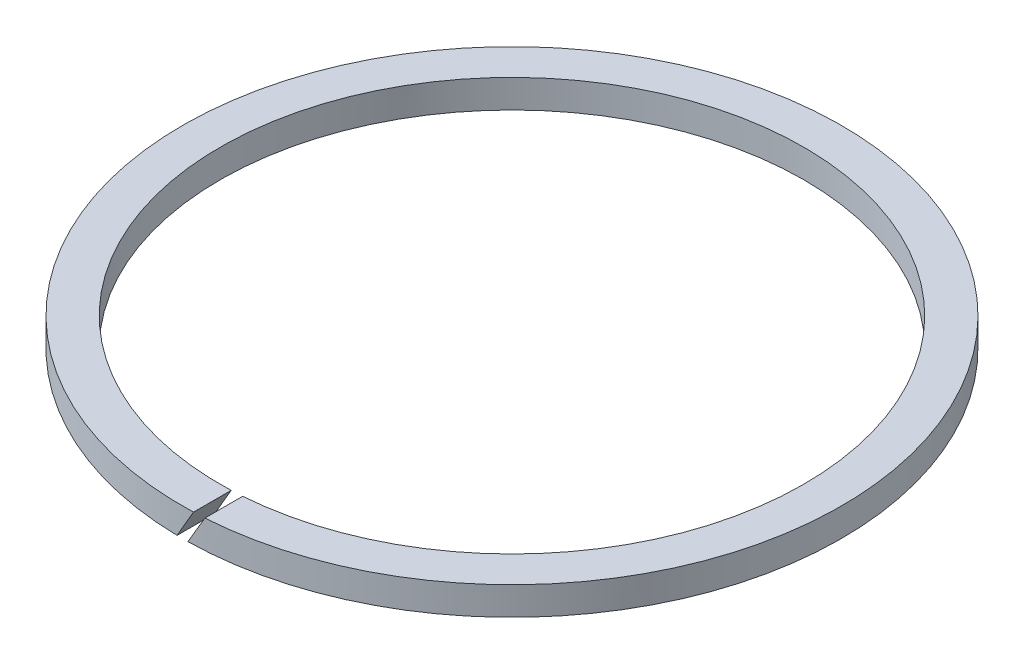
ISO-10303-21;
HEADER;
FILE_DESCRIPTION(('STEP AP214'),'2;1');
FILE_NAME('part.step','',(''),(''),'','','');
FILE_SCHEMA(('AUTOMOTIVE_DESIGN { 1 0 10303 214 1 1 1 1 }'));
ENDSEC;
DATA;
#1=APPLICATION_CONTEXT('core data for automotive mechanical design processes');
#2=APPLICATION_PROTOCOL_DEFINITION('international standard','automotive_design',2000,#1);
#3=PRODUCT_CONTEXT('',#1,'mechanical');
#4=PRODUCT('Part','Part','',(#3));
#5=PRODUCT_RELATED_PRODUCT_CATEGORY('part','',(#4));
#6=PRODUCT_DEFINITION_FORMATION('','',#4);
#7=PRODUCT_DEFINITION_CONTEXT('part definition',#1,'design');
#8=PRODUCT_DEFINITION('design','',#6,#7);
#9=PRODUCT_DEFINITION_SHAPE('','',#8);
#10=(LENGTH_UNIT() NAMED_UNIT(*) SI_UNIT(.MILLI.,.METRE.));
#11=(NAMED_UNIT(*) PLANE_ANGLE_UNIT() SI_UNIT($,.RADIAN.));
#12=(NAMED_UNIT(*) SI_UNIT($,.STERADIAN.) SOLID_ANGLE_UNIT());
#13=UNCERTAINTY_MEASURE_WITH_UNIT(LENGTH_MEASURE(1.E-05),#10,'distance_accuracy_value','');
#14=(GEOMETRIC_REPRESENTATION_CONTEXT(3) GLOBAL_UNCERTAINTY_ASSIGNED_CONTEXT((#13)) GLOBAL_UNIT_ASSIGNED_CONTEXT((#10,
#11,#12)) REPRESENTATION_CONTEXT('',''));
#15=CARTESIAN_POINT('',(0.,0.,0.));
#16=DIRECTION('',(0.,0.,1.));
#17=DIRECTION('',(1.,0.,0.));
#18=AXIS2_PLACEMENT_3D('',#15,#16,#17);
#19=CARTESIAN_POINT('',(0.,50.0339682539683,0.));
#20=DIRECTION('',(0.,1.,0.));
#21=DIRECTION('',(0.,0.,1.));
#22=AXIS2_PLACEMENT_3D('',#19,#20,#21);
#23=CYLINDRICAL_SURFACE('',#22,15.5);
#24=CARTESIAN_POINT('',(0.,0.500000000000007,0.));
#25=DIRECTION('',(0.86602540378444,-0.499999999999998,0.));
#26=DIRECTION('',(0.499999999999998,0.86602540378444,0.));
#27=AXIS2_PLACEMENT_3D('',#24,#25,#26);
#28=ELLIPSE('',#27,31.0000000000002,15.5);
#29=CARTESIAN_POINT('',(-0.288675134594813,0.,15.4973115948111));
#30=VERTEX_POINT('',#29);
#31=CARTESIAN_POINT('',(0.577350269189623,1.5,15.4892435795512));
#32=VERTEX_POINT('',#31);
#33=EDGE_CURVE('E86',#30,#32,#28,.F.);
#34=ORIENTED_EDGE('',*,*,#33,.F.);
#35=CARTESIAN_POINT('',(0.,0.,0.));
#36=DIRECTION('',(0.,1.,0.));
#37=DIRECTION('',(0.,0.,1.));
#38=AXIS2_PLACEMENT_3D('',#35,#36,#37);
#39=CIRCLE('',#38,15.5);
#40=CARTESIAN_POINT('',(0.288675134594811,0.,15.4973115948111));
#41=VERTEX_POINT('',#40);
#42=EDGE_CURVE('E83',#41,#30,#39,.T.);
#43=ORIENTED_EDGE('',*,*,#42,.F.);
#44=CARTESIAN_POINT('',(0.,-0.500000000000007,0.));
#45=DIRECTION('',(-0.86602540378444,0.499999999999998,0.));
#46=DIRECTION('',(0.499999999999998,0.86602540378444,0.));
#47=AXIS2_PLACEMENT_3D('',#44,#45,#46);
#48=ELLIPSE('',#47,31.0000000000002,15.5);
#49=CARTESIAN_POINT('',(1.15470053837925,1.5,15.4569294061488));
#50=VERTEX_POINT('',#49);
#51=EDGE_CURVE('E42',#50,#41,#48,.F.);
#52=ORIENTED_EDGE('',*,*,#51,.F.);
#53=CARTESIAN_POINT('',(0.,1.5,0.));
#54=DIRECTION('',(0.,1.,0.));
#55=DIRECTION('',(0.,0.,1.));
#56=AXIS2_PLACEMENT_3D('',#53,#54,#55);
#57=CIRCLE('',#56,15.5);
#58=EDGE_CURVE('E72',#50,#32,#57,.T.);
#59=ORIENTED_EDGE('',*,*,#58,.T.);
#60=EDGE_LOOP('',(#34,#43,#52,#59));
#61=FACE_BOUND('',#60,.T.);
#62=ADVANCED_FACE('F28',(#61),#23,.F.);
#63=CARTESIAN_POINT('',(15.5,1.5,0.));
#64=DIRECTION('',(0.,-1.,0.));
#65=DIRECTION('',(0.,0.,-1.));
#66=AXIS2_PLACEMENT_3D('',#63,#64,#65);
#67=PLANE('',#66);
#68=DIRECTION('',(0.,0.,1.));
#69=VECTOR('',#68,1.);
#70=CARTESIAN_POINT('',(0.577350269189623,1.5,0.));
#71=LINE('',#70,#69);
#72=CARTESIAN_POINT('',(0.577350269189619,1.5,17.4904735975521));
#73=VERTEX_POINT('',#72);
#74=EDGE_CURVE('E97',#32,#73,#71,.T.);
#75=ORIENTED_EDGE('',*,*,#74,.F.);
#76=ORIENTED_EDGE('',*,*,#58,.F.);
#77=DIRECTION('',(0.,0.,-1.));
#78=VECTOR('',#77,1.);
#79=CARTESIAN_POINT('',(1.15470053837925,1.5,0.));
#80=LINE('',#79,#78);
#81=CARTESIAN_POINT('',(1.15470053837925,1.5,17.4618632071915));
#82=VERTEX_POINT('',#81);
#83=EDGE_CURVE('E80',#82,#50,#80,.T.);
#84=ORIENTED_EDGE('',*,*,#83,.F.);
#85=CARTESIAN_POINT('',(0.,1.5,0.));
#86=DIRECTION('',(0.,1.,0.));
#87=DIRECTION('',(0.,0.,1.));
#88=AXIS2_PLACEMENT_3D('',#85,#86,#87);
#89=CIRCLE('',#88,17.5);
#90=EDGE_CURVE('E79',#82,#73,#89,.T.);
#91=ORIENTED_EDGE('',*,*,#90,.T.);
#92=EDGE_LOOP('',(#75,#76,#84,#91));
#93=FACE_BOUND('',#92,.T.);
#94=ADVANCED_FACE('F96',(#93),#67,.F.);
#95=CARTESIAN_POINT('',(0.,50.0339682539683,0.));
#96=DIRECTION('',(0.,1.,0.));
#97=DIRECTION('',(0.,0.,1.));
#98=AXIS2_PLACEMENT_3D('',#95,#96,#97);
#99=CYLINDRICAL_SURFACE('',#98,17.5);
#100=CARTESIAN_POINT('',(0.,0.500000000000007,0.));
#101=DIRECTION('',(0.86602540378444,-0.499999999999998,0.));
#102=DIRECTION('',(0.499999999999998,0.86602540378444,0.));
#103=AXIS2_PLACEMENT_3D('',#100,#101,#102);
#104=ELLIPSE('',#103,35.0000000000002,17.5);
#105=CARTESIAN_POINT('',(-0.288675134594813,0.,17.4976188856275));
#106=VERTEX_POINT('',#105);
#107=EDGE_CURVE('E49',#73,#106,#104,.T.);
#108=ORIENTED_EDGE('',*,*,#107,.F.);
#109=ORIENTED_EDGE('',*,*,#90,.F.);
#110=CARTESIAN_POINT('',(0.,-0.500000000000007,0.));
#111=DIRECTION('',(-0.86602540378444,0.499999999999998,0.));
#112=DIRECTION('',(0.499999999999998,0.86602540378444,0.));
#113=AXIS2_PLACEMENT_3D('',#110,#111,#112);
#114=ELLIPSE('',#113,35.0000000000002,17.5);
#115=CARTESIAN_POINT('',(0.288675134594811,0.,17.4976188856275));
#116=VERTEX_POINT('',#115);
#117=EDGE_CURVE('E66',#116,#82,#114,.T.);
#118=ORIENTED_EDGE('',*,*,#117,.F.);
#119=CARTESIAN_POINT('',(0.,0.,0.));
#120=DIRECTION('',(0.,1.,0.));
#121=DIRECTION('',(0.,0.,1.));
#122=AXIS2_PLACEMENT_3D('',#119,#120,#121);
#123=CIRCLE('',#122,17.5);
#124=EDGE_CURVE('E77',#116,#106,#123,.T.);
#125=ORIENTED_EDGE('',*,*,#124,.T.);
#126=EDGE_LOOP('',(#108,#109,#118,#125));
#127=FACE_BOUND('',#126,.T.);
#128=ADVANCED_FACE('F76',(#127),#99,.T.);
#129=CARTESIAN_POINT('',(15.5,0.,0.));
#130=DIRECTION('',(0.,1.,0.));
#131=DIRECTION('',(0.,0.,1.));
#132=AXIS2_PLACEMENT_3D('',#129,#130,#131);
#133=PLANE('',#132);
#134=DIRECTION('',(0.,0.,-1.));
#135=VECTOR('',#134,1.);
#136=CARTESIAN_POINT('',(-0.288675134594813,0.,0.));
#137=LINE('',#136,#135);
#138=EDGE_CURVE('E11',#106,#30,#137,.T.);
#139=ORIENTED_EDGE('',*,*,#138,.F.);
#140=ORIENTED_EDGE('',*,*,#124,.F.);
#141=DIRECTION('',(0.,0.,1.));
#142=VECTOR('',#141,1.);
#143=CARTESIAN_POINT('',(0.288675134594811,0.,0.));
#144=LINE('',#143,#142);
#145=EDGE_CURVE('E35',#41,#116,#144,.T.);
#146=ORIENTED_EDGE('',*,*,#145,.F.);
#147=ORIENTED_EDGE('',*,*,#42,.T.);
#148=EDGE_LOOP('',(#139,#140,#146,#147));
#149=FACE_BOUND('',#148,.T.);
#150=ADVANCED_FACE('F82',(#149),#133,.F.);
#151=CARTESIAN_POINT('',(1.94434002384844,2.8676957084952,17.5));
#152=DIRECTION('',(-0.86602540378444,0.499999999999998,0.));
#153=DIRECTION('',(-0.499999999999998,-0.86602540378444,0.));
#154=AXIS2_PLACEMENT_3D('',#151,#152,#153);
#155=PLANE('',#154);
#156=ORIENTED_EDGE('',*,*,#51,.T.);
#157=ORIENTED_EDGE('',*,*,#145,.T.);
#158=ORIENTED_EDGE('',*,*,#117,.T.);
#159=ORIENTED_EDGE('',*,*,#83,.T.);
#160=EDGE_LOOP('',(#156,#157,#158,#159));
#161=FACE_BOUND('',#160,.T.);
#162=ADVANCED_FACE('F65',(#161),#155,.T.);
#163=CARTESIAN_POINT('',(1.36698975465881,2.8676957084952,17.5));
#164=DIRECTION('',(0.86602540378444,-0.499999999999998,0.));
#165=DIRECTION('',(0.499999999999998,0.86602540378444,0.));
#166=AXIS2_PLACEMENT_3D('',#163,#164,#165);
#167=PLANE('',#166);
#168=ORIENTED_EDGE('',*,*,#33,.T.);
#169=ORIENTED_EDGE('',*,*,#74,.T.);
#170=ORIENTED_EDGE('',*,*,#107,.T.);
#171=ORIENTED_EDGE('',*,*,#138,.T.);
#172=EDGE_LOOP('',(#168,#169,#170,#171));
#173=FACE_BOUND('',#172,.T.);
#174=ADVANCED_FACE('F102',(#173),#167,.T.);
#175=CLOSED_SHELL('',(#62,#94,#128,#150,#162,#174));
#176=MANIFOLD_SOLID_BREP('B2',#175);
#177=ADVANCED_BREP_SHAPE_REPRESENTATION('',(#18,#176),#14);
#178=SHAPE_DEFINITION_REPRESENTATION(#9,#177);
ENDSEC;
END-ISO-10303-21;
